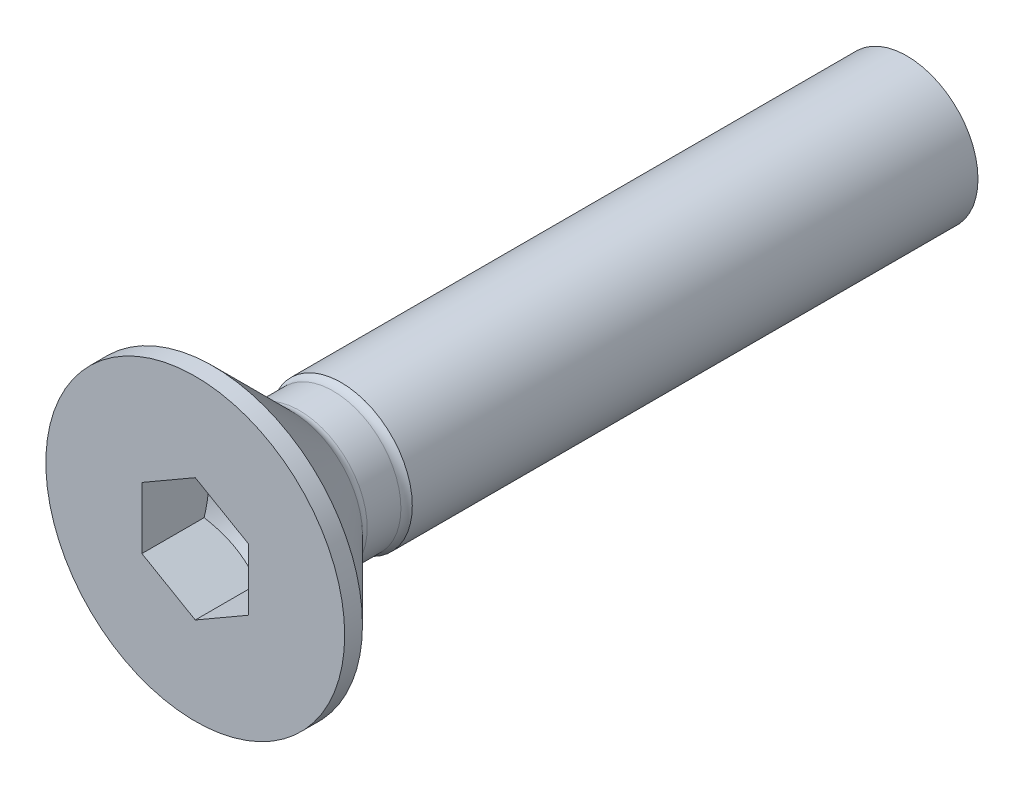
ISO-10303-21;
HEADER;
FILE_DESCRIPTION(('STEP AP214'),'2;1');
FILE_NAME('part.step','',(''),(''),'','','');
FILE_SCHEMA(('AUTOMOTIVE_DESIGN { 1 0 10303 214 1 1 1 1 }'));
ENDSEC;
DATA;
#1=APPLICATION_CONTEXT('core data for automotive mechanical design processes');
#2=APPLICATION_PROTOCOL_DEFINITION('international standard','automotive_design',2000,#1);
#3=PRODUCT_CONTEXT('',#1,'mechanical');
#4=PRODUCT('Part','Part','',(#3));
#5=PRODUCT_RELATED_PRODUCT_CATEGORY('part','',(#4));
#6=PRODUCT_DEFINITION_FORMATION('','',#4);
#7=PRODUCT_DEFINITION_CONTEXT('part definition',#1,'design');
#8=PRODUCT_DEFINITION('design','',#6,#7);
#9=PRODUCT_DEFINITION_SHAPE('','',#8);
#10=(LENGTH_UNIT() NAMED_UNIT(*) SI_UNIT(.MILLI.,.METRE.));
#11=(NAMED_UNIT(*) PLANE_ANGLE_UNIT() SI_UNIT($,.RADIAN.));
#12=(NAMED_UNIT(*) SI_UNIT($,.STERADIAN.) SOLID_ANGLE_UNIT());
#13=UNCERTAINTY_MEASURE_WITH_UNIT(LENGTH_MEASURE(1.E-05),#10,'distance_accuracy_value','');
#14=(GEOMETRIC_REPRESENTATION_CONTEXT(3) GLOBAL_UNCERTAINTY_ASSIGNED_CONTEXT((#13)) GLOBAL_UNIT_ASSIGNED_CONTEXT((#10,
#11,#12)) REPRESENTATION_CONTEXT('',''));
#15=CARTESIAN_POINT('',(0.,0.,0.));
#16=DIRECTION('',(0.,0.,1.));
#17=DIRECTION('',(1.,0.,0.));
#18=AXIS2_PLACEMENT_3D('',#15,#16,#17);
#19=CARTESIAN_POINT('',(0.,4.2,0.));
#20=DIRECTION('',(0.,0.,-1.));
#21=DIRECTION('',(-1.,0.,0.));
#22=AXIS2_PLACEMENT_3D('',#19,#20,#21);
#23=PLANE('',#22);
#24=CARTESIAN_POINT('',(0.,0.,0.));
#25=DIRECTION('',(0.,0.,1.));
#26=DIRECTION('',(1.,0.,0.));
#27=AXIS2_PLACEMENT_3D('',#24,#25,#26);
#28=CIRCLE('',#27,4.2);
#29=CARTESIAN_POINT('',(4.2,0.,0.));
#30=VERTEX_POINT('',#29);
#31=EDGE_CURVE('E107',#30,#30,#28,.T.);
#32=ORIENTED_EDGE('',*,*,#31,.T.);
#33=EDGE_LOOP('',(#32));
#34=FACE_BOUND('',#33,.T.);
#35=DIRECTION('',(-0.866025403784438,-0.5,0.));
#36=VECTOR('',#35,1.);
#37=CARTESIAN_POINT('',(1.49999930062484,-0.866025,0.));
#38=LINE('',#37,#36);
#39=CARTESIAN_POINT('',(1.49999930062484,-0.866025,0.));
#40=VERTEX_POINT('',#39);
#41=CARTESIAN_POINT('',(0.,-1.73205,0.));
#42=VERTEX_POINT('',#41);
#43=EDGE_CURVE('E30',#40,#42,#38,.T.);
#44=ORIENTED_EDGE('',*,*,#43,.T.);
#45=DIRECTION('',(-0.866025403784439,0.5,0.));
#46=VECTOR('',#45,1.);
#47=CARTESIAN_POINT('',(0.,-1.73205,0.));
#48=LINE('',#47,#46);
#49=CARTESIAN_POINT('',(-1.49999930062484,-0.866025,0.));
#50=VERTEX_POINT('',#49);
#51=EDGE_CURVE('E176',#42,#50,#48,.T.);
#52=ORIENTED_EDGE('',*,*,#51,.T.);
#53=DIRECTION('',(0.,1.,0.));
#54=VECTOR('',#53,1.);
#55=CARTESIAN_POINT('',(-1.49999930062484,-0.866025,0.));
#56=LINE('',#55,#54);
#57=CARTESIAN_POINT('',(-1.49999930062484,0.866025,0.));
#58=VERTEX_POINT('',#57);
#59=EDGE_CURVE('E231',#50,#58,#56,.T.);
#60=ORIENTED_EDGE('',*,*,#59,.T.);
#61=DIRECTION('',(0.866025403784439,0.5,0.));
#62=VECTOR('',#61,1.);
#63=CARTESIAN_POINT('',(-1.49999930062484,0.866025,0.));
#64=LINE('',#63,#62);
#65=CARTESIAN_POINT('',(0.,1.73205,0.));
#66=VERTEX_POINT('',#65);
#67=EDGE_CURVE('E229',#58,#66,#64,.T.);
#68=ORIENTED_EDGE('',*,*,#67,.T.);
#69=DIRECTION('',(0.866025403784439,-0.5,0.));
#70=VECTOR('',#69,1.);
#71=CARTESIAN_POINT('',(0.,1.73205,0.));
#72=LINE('',#71,#70);
#73=CARTESIAN_POINT('',(1.49999930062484,0.866025,0.));
#74=VERTEX_POINT('',#73);
#75=EDGE_CURVE('E96',#66,#74,#72,.T.);
#76=ORIENTED_EDGE('',*,*,#75,.T.);
#77=DIRECTION('',(0.,-1.,0.));
#78=VECTOR('',#77,1.);
#79=CARTESIAN_POINT('',(1.49999930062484,0.866025,0.));
#80=LINE('',#79,#78);
#81=EDGE_CURVE('E92',#74,#40,#80,.T.);
#82=ORIENTED_EDGE('',*,*,#81,.T.);
#83=EDGE_LOOP('',(#44,#52,#60,#68,#76,#82));
#84=FACE_BOUND('',#83,.T.);
#85=ADVANCED_FACE('F16',(#34,#84),#23,.F.);
#86=CARTESIAN_POINT('',(0.,0.,-20.));
#87=DIRECTION('',(0.,0.,1.));
#88=DIRECTION('',(1.,0.,0.));
#89=AXIS2_PLACEMENT_3D('',#86,#87,#88);
#90=PLANE('',#89);
#91=CARTESIAN_POINT('',(0.,0.,-20.));
#92=DIRECTION('',(0.,0.,1.));
#93=DIRECTION('',(1.,0.,0.));
#94=AXIS2_PLACEMENT_3D('',#91,#92,#93);
#95=CIRCLE('',#94,2.);
#96=CARTESIAN_POINT('',(2.,0.,-20.));
#97=VERTEX_POINT('',#96);
#98=EDGE_CURVE('E11',#97,#97,#95,.T.);
#99=ORIENTED_EDGE('',*,*,#98,.F.);
#100=EDGE_LOOP('',(#99));
#101=FACE_BOUND('',#100,.T.);
#102=ADVANCED_FACE('F130',(#101),#90,.F.);
#103=CARTESIAN_POINT('',(0.,0.,0.));
#104=DIRECTION('',(0.,0.,1.));
#105=DIRECTION('',(1.,0.,0.));
#106=AXIS2_PLACEMENT_3D('',#103,#104,#105);
#107=CYLINDRICAL_SURFACE('',#106,2.);
#108=CARTESIAN_POINT('',(0.,0.,-4.1));
#109=DIRECTION('',(0.,0.,1.));
#110=DIRECTION('',(1.,0.,0.));
#111=AXIS2_PLACEMENT_3D('',#108,#109,#110);
#112=CIRCLE('',#111,2.);
#113=CARTESIAN_POINT('',(2.,0.,-4.1));
#114=VERTEX_POINT('',#113);
#115=EDGE_CURVE('E23',#114,#114,#112,.T.);
#116=ORIENTED_EDGE('',*,*,#115,.F.);
#117=EDGE_LOOP('',(#116));
#118=FACE_BOUND('',#117,.T.);
#119=ORIENTED_EDGE('',*,*,#98,.T.);
#120=EDGE_LOOP('',(#119));
#121=FACE_BOUND('',#120,.T.);
#122=ADVANCED_FACE('F127',(#118,#121),#107,.T.);
#123=CARTESIAN_POINT('',(0.,0.,-3.8737258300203));
#124=DIRECTION('',(0.,0.,1.));
#125=DIRECTION('',(1.,0.,0.));
#126=AXIS2_PLACEMENT_3D('',#123,#124,#125);
#127=TOROIDAL_SURFACE('',#126,2.2262741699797,0.32);
#128=ORIENTED_EDGE('',*,*,#115,.T.);
#129=EDGE_LOOP('',(#128));
#130=FACE_BOUND('',#129,.T.);
#131=CARTESIAN_POINT('',(0.,0.,-3.8737258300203));
#132=DIRECTION('',(0.,0.,1.));
#133=DIRECTION('',(1.,0.,0.));
#134=AXIS2_PLACEMENT_3D('',#131,#132,#133);
#135=CIRCLE('',#134,1.9062741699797);
#136=CARTESIAN_POINT('',(1.9062741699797,0.,-3.8737258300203));
#137=VERTEX_POINT('',#136);
#138=EDGE_CURVE('E119',#137,#137,#135,.T.);
#139=ORIENTED_EDGE('',*,*,#138,.F.);
#140=EDGE_LOOP('',(#139));
#141=FACE_BOUND('',#140,.T.);
#142=ADVANCED_FACE('F124',(#130,#141),#127,.F.);
#143=CARTESIAN_POINT('',(0.,0.,0.));
#144=DIRECTION('',(0.,0.,1.));
#145=DIRECTION('',(1.,0.,0.));
#146=AXIS2_PLACEMENT_3D('',#143,#144,#145);
#147=CYLINDRICAL_SURFACE('',#146,1.9062741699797);
#148=CARTESIAN_POINT('',(0.,0.,-2.9262741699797));
#149=DIRECTION('',(0.,0.,1.));
#150=DIRECTION('',(1.,0.,0.));
#151=AXIS2_PLACEMENT_3D('',#148,#149,#150);
#152=CIRCLE('',#151,1.9062741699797);
#153=CARTESIAN_POINT('',(1.9062741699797,0.,-2.9262741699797));
#154=VERTEX_POINT('',#153);
#155=EDGE_CURVE('E116',#154,#154,#152,.T.);
#156=ORIENTED_EDGE('',*,*,#155,.F.);
#157=EDGE_LOOP('',(#156));
#158=FACE_BOUND('',#157,.T.);
#159=ORIENTED_EDGE('',*,*,#138,.T.);
#160=EDGE_LOOP('',(#159));
#161=FACE_BOUND('',#160,.T.);
#162=ADVANCED_FACE('F143',(#158,#161),#147,.T.);
#163=CARTESIAN_POINT('',(0.,0.,-2.9262741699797));
#164=DIRECTION('',(0.,0.,1.));
#165=DIRECTION('',(1.,0.,0.));
#166=AXIS2_PLACEMENT_3D('',#163,#164,#165);
#167=TOROIDAL_SURFACE('',#166,2.2262741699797,0.32);
#168=ORIENTED_EDGE('',*,*,#155,.T.);
#169=EDGE_LOOP('',(#168));
#170=FACE_BOUND('',#169,.T.);
#171=CARTESIAN_POINT('',(0.,0.,-2.7));
#172=DIRECTION('',(0.,0.,1.));
#173=DIRECTION('',(1.,0.,0.));
#174=AXIS2_PLACEMENT_3D('',#171,#172,#173);
#175=CIRCLE('',#174,2.);
#176=CARTESIAN_POINT('',(2.,0.,-2.7));
#177=VERTEX_POINT('',#176);
#178=EDGE_CURVE('E113',#177,#177,#175,.T.);
#179=ORIENTED_EDGE('',*,*,#178,.F.);
#180=EDGE_LOOP('',(#179));
#181=FACE_BOUND('',#180,.T.);
#182=ADVANCED_FACE('F146',(#170,#181),#167,.F.);
#183=CARTESIAN_POINT('',(0.,0.,-2.7));
#184=DIRECTION('',(0.,0.,1.));
#185=DIRECTION('',(1.,0.,0.));
#186=AXIS2_PLACEMENT_3D('',#183,#184,#185);
#187=CONICAL_SURFACE('',#186,2.,0.785398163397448);
#188=CARTESIAN_POINT('',(0.,0.,-0.5));
#189=DIRECTION('',(0.,0.,1.));
#190=DIRECTION('',(1.,0.,0.));
#191=AXIS2_PLACEMENT_3D('',#188,#189,#190);
#192=CIRCLE('',#191,4.2);
#193=CARTESIAN_POINT('',(4.2,0.,-0.5));
#194=VERTEX_POINT('',#193);
#195=EDGE_CURVE('E110',#194,#194,#192,.T.);
#196=ORIENTED_EDGE('',*,*,#195,.F.);
#197=EDGE_LOOP('',(#196));
#198=FACE_BOUND('',#197,.T.);
#199=ORIENTED_EDGE('',*,*,#178,.T.);
#200=EDGE_LOOP('',(#199));
#201=FACE_BOUND('',#200,.T.);
#202=ADVANCED_FACE('F150',(#198,#201),#187,.T.);
#203=CARTESIAN_POINT('',(0.,0.,0.));
#204=DIRECTION('',(0.,0.,1.));
#205=DIRECTION('',(1.,0.,0.));
#206=AXIS2_PLACEMENT_3D('',#203,#204,#205);
#207=CYLINDRICAL_SURFACE('',#206,4.2);
#208=ORIENTED_EDGE('',*,*,#31,.F.);
#209=EDGE_LOOP('',(#208));
#210=FACE_BOUND('',#209,.T.);
#211=ORIENTED_EDGE('',*,*,#195,.T.);
#212=EDGE_LOOP('',(#211));
#213=FACE_BOUND('',#212,.T.);
#214=ADVANCED_FACE('F154',(#210,#213),#207,.T.);
#215=CARTESIAN_POINT('',(1.49999930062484,-0.866025,-2.74999953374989));
#216=DIRECTION('',(-0.5,0.866025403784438,0.));
#217=DIRECTION('',(0.866025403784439,0.5,0.));
#218=AXIS2_PLACEMENT_3D('',#215,#216,#217);
#219=PLANE('',#218);
#220=DIRECTION('',(0.,0.,1.));
#221=VECTOR('',#220,1.);
#222=CARTESIAN_POINT('',(0.,-1.73205,-2.74999953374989));
#223=LINE('',#222,#221);
#224=CARTESIAN_POINT('',(0.,-1.73205,-1.75));
#225=VERTEX_POINT('',#224);
#226=EDGE_CURVE('E105',#225,#42,#223,.T.);
#227=ORIENTED_EDGE('',*,*,#226,.T.);
#228=ORIENTED_EDGE('',*,*,#43,.F.);
#229=DIRECTION('',(0.,0.,1.));
#230=VECTOR('',#229,1.);
#231=CARTESIAN_POINT('',(1.49999930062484,-0.866025,-2.74999953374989));
#232=LINE('',#231,#230);
#233=CARTESIAN_POINT('',(1.49999930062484,-0.866025,-1.75));
#234=VERTEX_POINT('',#233);
#235=EDGE_CURVE('E86',#234,#40,#232,.T.);
#236=ORIENTED_EDGE('',*,*,#235,.F.);
#237=CARTESIAN_POINT('',(-1.99999999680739E-07,-1.73205011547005,-1.74999993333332));
#238=CARTESIAN_POINT('',(0.0659156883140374,-1.69399355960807,-1.77197826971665));
#239=CARTESIAN_POINT('',(0.132400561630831,-1.65560850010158,-1.79196641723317));
#240=CARTESIAN_POINT('',(0.266521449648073,-1.57817376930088,-1.82685513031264));
#241=CARTESIAN_POINT('',(0.334159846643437,-1.53912272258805,-1.84174335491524));
#242=CARTESIAN_POINT('',(0.468598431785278,-1.46150456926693,-1.86491795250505));
#243=CARTESIAN_POINT('',(0.535377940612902,-1.42294940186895,-1.87335858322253));
#244=CARTESIAN_POINT('',(0.669251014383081,-1.3456577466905,-1.88343305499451));
#245=CARTESIAN_POINT('',(0.736344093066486,-1.30692153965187,-1.88507524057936));
#246=CARTESIAN_POINT('',(0.861700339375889,-1.23454707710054,-1.88165022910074));
#247=CARTESIAN_POINT('',(0.919982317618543,-1.20089796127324,-1.87742398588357));
#248=CARTESIAN_POINT('',(1.03616658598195,-1.13381894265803,-1.86403197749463));
#249=CARTESIAN_POINT('',(1.09406847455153,-1.10038927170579,-1.8548616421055));
#250=CARTESIAN_POINT('',(1.21049209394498,-1.03317206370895,-1.83193757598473));
#251=CARTESIAN_POINT('',(1.26899909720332,-0.99939302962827,-1.81808671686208));
#252=CARTESIAN_POINT('',(1.38514072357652,-0.932338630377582,-1.78665112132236));
#253=CARTESIAN_POINT('',(1.44277683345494,-0.899062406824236,-1.76907376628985));
#254=CARTESIAN_POINT('',(1.49999950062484,-0.866024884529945,-1.74999993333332));
#255=B_SPLINE_CURVE_WITH_KNOTS('',3,(#237,#238,#239,#240,#241,#242,#243,#244,#245,#246,#247,
#248,#249,#250,#251,#252,#253,#254),.UNSPECIFIED.,.F.,.F.,(4,2,2,2,2,2,2,2,4),(0.,
0.237761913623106,0.476095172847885,0.708530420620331,0.940680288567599,1.14278046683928,
1.34506778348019,1.5518408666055,1.75820814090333),.UNSPECIFIED.);
#256=EDGE_CURVE('E79',#225,#234,#255,.T.);
#257=ORIENTED_EDGE('',*,*,#256,.F.);
#258=EDGE_LOOP('',(#227,#228,#236,#257));
#259=FACE_BOUND('',#258,.T.);
#260=ADVANCED_FACE('F87',(#259),#219,.T.);
#261=CARTESIAN_POINT('',(0.,-1.73205,-2.74999953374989));
#262=DIRECTION('',(0.5,0.866025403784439,0.));
#263=DIRECTION('',(0.866025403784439,-0.5,0.));
#264=AXIS2_PLACEMENT_3D('',#261,#262,#263);
#265=PLANE('',#264);
#266=DIRECTION('',(0.,0.,1.));
#267=VECTOR('',#266,1.);
#268=CARTESIAN_POINT('',(-1.49999930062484,-0.866025,-2.74999953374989));
#269=LINE('',#268,#267);
#270=CARTESIAN_POINT('',(-1.49999930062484,-0.866025,-1.75));
#271=VERTEX_POINT('',#270);
#272=EDGE_CURVE('E103',#271,#50,#269,.T.);
#273=ORIENTED_EDGE('',*,*,#272,.T.);
#274=ORIENTED_EDGE('',*,*,#51,.F.);
#275=ORIENTED_EDGE('',*,*,#226,.F.);
#276=CARTESIAN_POINT('',(-1.49999950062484,-0.866024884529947,-1.74999993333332));
#277=CARTESIAN_POINT('',(-1.4340836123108,-0.904081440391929,-1.77197826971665));
#278=CARTESIAN_POINT('',(-1.36759873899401,-0.942466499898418,-1.79196641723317));
#279=CARTESIAN_POINT('',(-1.23347785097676,-1.01990123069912,-1.82685513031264));
#280=CARTESIAN_POINT('',(-1.1658394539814,-1.05895227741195,-1.84174335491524));
#281=CARTESIAN_POINT('',(-1.03140086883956,-1.13657043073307,-1.86491795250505));
#282=CARTESIAN_POINT('',(-0.964621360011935,-1.17512559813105,-1.87335858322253));
#283=CARTESIAN_POINT('',(-0.830748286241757,-1.2524172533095,-1.88343305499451));
#284=CARTESIAN_POINT('',(-0.763655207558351,-1.29115346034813,-1.88507524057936));
#285=CARTESIAN_POINT('',(-0.638298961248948,-1.36352792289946,-1.88165022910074));
#286=CARTESIAN_POINT('',(-0.580016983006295,-1.39717703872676,-1.87742398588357));
#287=CARTESIAN_POINT('',(-0.46383271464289,-1.46425605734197,-1.86403197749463));
#288=CARTESIAN_POINT('',(-0.405930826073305,-1.49768572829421,-1.8548616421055));
#289=CARTESIAN_POINT('',(-0.289507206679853,-1.56490293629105,-1.83193757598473));
#290=CARTESIAN_POINT('',(-0.231000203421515,-1.59868197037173,-1.81808671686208));
#291=CARTESIAN_POINT('',(-0.114858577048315,-1.66573636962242,-1.78665112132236));
#292=CARTESIAN_POINT('',(-0.0572224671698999,-1.69901259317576,-1.76907376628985));
#293=CARTESIAN_POINT('',(2.00000000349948E-07,-1.73205011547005,-1.74999993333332));
#294=B_SPLINE_CURVE_WITH_KNOTS('',3,(#276,#277,#278,#279,#280,#281,#282,#283,#284,#285,#286,
#287,#288,#289,#290,#291,#292,#293),.UNSPECIFIED.,.F.,.F.,(4,2,2,2,2,2,2,2,4),(0.,
0.237761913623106,0.476095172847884,0.70853042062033,0.940680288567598,1.14278046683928,
1.34506778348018,1.5518408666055,1.75820814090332),.UNSPECIFIED.);
#295=EDGE_CURVE('E83',#271,#225,#294,.T.);
#296=ORIENTED_EDGE('',*,*,#295,.F.);
#297=EDGE_LOOP('',(#273,#274,#275,#296));
#298=FACE_BOUND('',#297,.T.);
#299=ADVANCED_FACE('F162',(#298),#265,.T.);
#300=CARTESIAN_POINT('',(-1.49999930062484,-0.866025,-2.74999953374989));
#301=DIRECTION('',(1.,0.,0.));
#302=DIRECTION('',(0.,-1.,0.));
#303=AXIS2_PLACEMENT_3D('',#300,#301,#302);
#304=PLANE('',#303);
#305=DIRECTION('',(0.,0.,1.));
#306=VECTOR('',#305,1.);
#307=CARTESIAN_POINT('',(-1.49999930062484,0.866025,-2.74999953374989));
#308=LINE('',#307,#306);
#309=CARTESIAN_POINT('',(-1.49999930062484,0.866025,-1.75));
#310=VERTEX_POINT('',#309);
#311=EDGE_CURVE('E101',#310,#58,#308,.T.);
#312=ORIENTED_EDGE('',*,*,#311,.T.);
#313=ORIENTED_EDGE('',*,*,#59,.F.);
#314=ORIENTED_EDGE('',*,*,#272,.F.);
#315=CARTESIAN_POINT('',(-1.49999930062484,-2.24271663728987,-1.19224732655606));
#316=CARTESIAN_POINT('',(-1.49999930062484,-2.17794141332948,-1.2233240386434));
#317=CARTESIAN_POINT('',(-1.49999930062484,-2.11300852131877,-1.25407788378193));
#318=CARTESIAN_POINT('',(-1.49999930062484,-1.98274303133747,-1.31475688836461));
#319=CARTESIAN_POINT('',(-1.49999930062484,-1.91741036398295,-1.34468189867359));
#320=CARTESIAN_POINT('',(-1.49999930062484,-1.78588635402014,-1.40368745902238));
#321=CARTESIAN_POINT('',(-1.49999930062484,-1.71969220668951,-1.43276178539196));
#322=CARTESIAN_POINT('',(-1.49999930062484,-1.58674953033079,-1.48960603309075));
#323=CARTESIAN_POINT('',(-1.49999930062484,-1.52000103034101,-1.51737602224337));
#324=CARTESIAN_POINT('',(-1.49999930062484,-1.3840803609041,-1.57197454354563));
#325=CARTESIAN_POINT('',(-1.49999930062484,-1.31489044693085,-1.59875948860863));
#326=CARTESIAN_POINT('',(-1.49999930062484,-1.17568875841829,-1.65009347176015));
#327=CARTESIAN_POINT('',(-1.49999930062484,-1.10567688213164,-1.67464222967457));
#328=CARTESIAN_POINT('',(-1.49999930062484,-0.894522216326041,-1.74389891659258));
#329=CARTESIAN_POINT('',(-1.49999930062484,-0.751873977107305,-1.78437972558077));
#330=CARTESIAN_POINT('',(-1.49999930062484,-0.535047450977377,-1.83133547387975));
#331=CARTESIAN_POINT('',(-1.49999930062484,-0.462365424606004,-1.8446870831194));
#332=CARTESIAN_POINT('',(-1.49999930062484,-0.316183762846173,-1.86588652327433));
#333=CARTESIAN_POINT('',(-1.49999930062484,-0.242684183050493,-1.8737347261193));
#334=CARTESIAN_POINT('',(-1.49999930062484,-0.0961588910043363,-1.88320140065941));
#335=CARTESIAN_POINT('',(-1.49999930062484,-0.0231380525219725,-1.88489338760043));
#336=CARTESIAN_POINT('',(-1.49999930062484,0.122783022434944,-1.8821005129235));
#337=CARTESIAN_POINT('',(-1.49999930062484,0.195683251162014,-1.87761526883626));
#338=CARTESIAN_POINT('',(-1.49999930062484,0.375553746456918,-1.85932231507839));
#339=CARTESIAN_POINT('',(-1.49999930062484,0.482175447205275,-1.84208645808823));
#340=CARTESIAN_POINT('',(-1.49999930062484,0.693345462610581,-1.79764015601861));
#341=CARTESIAN_POINT('',(-1.49999930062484,0.797891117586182,-1.77041768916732));
#342=CARTESIAN_POINT('',(-1.49999930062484,0.954250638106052,-1.72391506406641));
#343=CARTESIAN_POINT('',(-1.49999930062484,1.00687274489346,-1.70725248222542));
#344=CARTESIAN_POINT('',(-1.49999930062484,1.11156919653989,-1.67238593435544));
#345=CARTESIAN_POINT('',(-1.49999930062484,1.16364386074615,-1.65418293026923));
#346=CARTESIAN_POINT('',(-1.49999930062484,1.26731501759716,-1.61649989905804));
#347=CARTESIAN_POINT('',(-1.49999930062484,1.31891159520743,-1.59702010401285));
#348=CARTESIAN_POINT('',(-1.49999930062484,1.4216981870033,-1.55699419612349));
#349=CARTESIAN_POINT('',(-1.49999930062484,1.472888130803,-1.53644790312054));
#350=CARTESIAN_POINT('',(-1.49999930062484,1.60355204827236,-1.48268670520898));
#351=CARTESIAN_POINT('',(-1.49999930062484,1.68276475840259,-1.44883749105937));
#352=CARTESIAN_POINT('',(-1.49999930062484,1.84047486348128,-1.37950734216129));
#353=CARTESIAN_POINT('',(-1.49999930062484,1.91897220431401,-1.34402628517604));
#354=CARTESIAN_POINT('',(-1.49999930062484,2.15362953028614,-1.23571059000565));
#355=CARTESIAN_POINT('',(-1.49999930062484,2.30892860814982,-1.16101453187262));
#356=CARTESIAN_POINT('',(-1.49999930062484,2.61819999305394,-1.00848967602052));
#357=CARTESIAN_POINT('',(-1.49999930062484,2.77217043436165,-0.930657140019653));
#358=CARTESIAN_POINT('',(-1.49999930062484,3.07905639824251,-0.772990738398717));
#359=CARTESIAN_POINT('',(-1.49999930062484,3.23197205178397,-0.693157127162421));
#360=CARTESIAN_POINT('',(-1.49999930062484,3.52267463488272,-0.539711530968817));
#361=CARTESIAN_POINT('',(-1.49999930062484,3.66052723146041,-0.466223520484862));
#362=CARTESIAN_POINT('',(-1.49999930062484,3.93578899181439,-0.318410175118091));
#363=CARTESIAN_POINT('',(-1.49999930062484,4.07319813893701,-0.244084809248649));
#364=CARTESIAN_POINT('',(-1.49999930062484,4.34732572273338,-0.0949965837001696));
#365=CARTESIAN_POINT('',(-1.49999930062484,4.48404502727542,-0.0202353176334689));
#366=CARTESIAN_POINT('',(-1.49999930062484,4.75720722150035,0.129773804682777));
#367=CARTESIAN_POINT('',(-1.49999930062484,4.89365012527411,0.205021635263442));
#368=CARTESIAN_POINT('',(-1.49999930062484,5.02999372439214,0.280447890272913));
#369=B_SPLINE_CURVE_WITH_KNOTS('',3,(#315,#316,#317,#318,#319,#320,#321,#322,#323,#324,#325,
#326,#327,#328,#329,#330,#331,#332,#333,#334,#335,#336,#337,#338,#339,#340,#341,#342,#343,#344,
#345,#346,#347,#348,#349,#350,#351,#352,#353,#354,#355,#356,#357,#358,#359,#360,#361,#362,#363,
#364,#365,#366,#367,#368),.UNSPECIFIED.,.F.,.F.,(4,2,2,2,2,2,2,2,2,2,2,2,2,2,2,2,2,2,2,2,2,2,2,
2,2,2,4),(0.,0.215535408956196,0.431109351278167,0.647990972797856,0.864861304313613,
1.08740082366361,1.30996818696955,1.75384735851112,1.97537373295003,2.19688513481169,
2.41574248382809,2.63461338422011,2.95796620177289,3.28170955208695,3.4472828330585,
3.61275347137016,3.77819411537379,3.94366279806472,4.20206177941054,4.46048014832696,
4.97740223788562,5.49495979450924,6.012451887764,6.48110033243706,6.94976617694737,
7.41723996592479,7.88468929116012),.UNSPECIFIED.);
#370=EDGE_CURVE('E204',#310,#271,#369,.F.);
#371=ORIENTED_EDGE('',*,*,#370,.F.);
#372=EDGE_LOOP('',(#312,#313,#314,#371));
#373=FACE_BOUND('',#372,.T.);
#374=ADVANCED_FACE('F209',(#373),#304,.T.);
#375=CARTESIAN_POINT('',(-1.49999930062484,0.866025,-2.74999953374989));
#376=DIRECTION('',(0.5,-0.866025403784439,0.));
#377=DIRECTION('',(-0.866025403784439,-0.5,0.));
#378=AXIS2_PLACEMENT_3D('',#375,#376,#377);
#379=PLANE('',#378);
#380=DIRECTION('',(0.,0.,1.));
#381=VECTOR('',#380,1.);
#382=CARTESIAN_POINT('',(0.,1.73205,-2.74999953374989));
#383=LINE('',#382,#381);
#384=CARTESIAN_POINT('',(0.,1.73205,-1.75));
#385=VERTEX_POINT('',#384);
#386=EDGE_CURVE('E94',#385,#66,#383,.T.);
#387=ORIENTED_EDGE('',*,*,#386,.T.);
#388=ORIENTED_EDGE('',*,*,#67,.F.);
#389=ORIENTED_EDGE('',*,*,#311,.F.);
#390=CARTESIAN_POINT('',(1.99999999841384E-07,1.73205011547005,-1.74999993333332));
#391=CARTESIAN_POINT('',(-0.0659156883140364,1.69399355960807,-1.77197826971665));
#392=CARTESIAN_POINT('',(-0.13240056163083,1.65560850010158,-1.79196641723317));
#393=CARTESIAN_POINT('',(-0.266521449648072,1.57817376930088,-1.82685513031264));
#394=CARTESIAN_POINT('',(-0.334159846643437,1.53912272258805,-1.84174335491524));
#395=CARTESIAN_POINT('',(-0.468598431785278,1.46150456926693,-1.86491795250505));
#396=CARTESIAN_POINT('',(-0.535377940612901,1.42294940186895,-1.87335858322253));
#397=CARTESIAN_POINT('',(-0.66925101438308,1.3456577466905,-1.88343305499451));
#398=CARTESIAN_POINT('',(-0.736344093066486,1.30692153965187,-1.88507524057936));
#399=CARTESIAN_POINT('',(-0.861700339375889,1.23454707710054,-1.88165022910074));
#400=CARTESIAN_POINT('',(-0.919982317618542,1.20089796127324,-1.87742398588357));
#401=CARTESIAN_POINT('',(-1.03616658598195,1.13381894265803,-1.86403197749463));
#402=CARTESIAN_POINT('',(-1.09406847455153,1.10038927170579,-1.8548616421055));
#403=CARTESIAN_POINT('',(-1.21049209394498,1.03317206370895,-1.83193757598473));
#404=CARTESIAN_POINT('',(-1.26899909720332,0.99939302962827,-1.81808671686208));
#405=CARTESIAN_POINT('',(-1.38514072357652,0.932338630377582,-1.78665112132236));
#406=CARTESIAN_POINT('',(-1.44277683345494,0.899062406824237,-1.76907376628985));
#407=CARTESIAN_POINT('',(-1.49999950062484,0.866024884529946,-1.74999993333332));
#408=B_SPLINE_CURVE_WITH_KNOTS('',3,(#390,#391,#392,#393,#394,#395,#396,#397,#398,#399,#400,
#401,#402,#403,#404,#405,#406,#407),.UNSPECIFIED.,.F.,.F.,(4,2,2,2,2,2,2,2,4),(0.,
0.237761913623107,0.476095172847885,0.708530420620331,0.940680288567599,1.14278046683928,
1.34506778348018,1.5518408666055,1.75820814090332),.UNSPECIFIED.);
#409=EDGE_CURVE('E198',#385,#310,#408,.T.);
#410=ORIENTED_EDGE('',*,*,#409,.F.);
#411=EDGE_LOOP('',(#387,#388,#389,#410));
#412=FACE_BOUND('',#411,.T.);
#413=ADVANCED_FACE('F212',(#412),#379,.T.);
#414=CARTESIAN_POINT('',(0.,1.73205,-2.74999953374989));
#415=DIRECTION('',(-0.5,-0.866025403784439,0.));
#416=DIRECTION('',(-0.866025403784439,0.5,0.));
#417=AXIS2_PLACEMENT_3D('',#414,#415,#416);
#418=PLANE('',#417);
#419=DIRECTION('',(0.,0.,1.));
#420=VECTOR('',#419,1.);
#421=CARTESIAN_POINT('',(1.49999930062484,0.866025,-2.74999953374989));
#422=LINE('',#421,#420);
#423=CARTESIAN_POINT('',(1.49999930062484,0.866025,-1.75));
#424=VERTEX_POINT('',#423);
#425=EDGE_CURVE('E91',#424,#74,#422,.T.);
#426=ORIENTED_EDGE('',*,*,#425,.T.);
#427=ORIENTED_EDGE('',*,*,#75,.F.);
#428=ORIENTED_EDGE('',*,*,#386,.F.);
#429=CARTESIAN_POINT('',(1.49999950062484,0.866024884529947,-1.74999993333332));
#430=CARTESIAN_POINT('',(1.4340836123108,0.90408144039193,-1.77197826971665));
#431=CARTESIAN_POINT('',(1.36759873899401,0.942466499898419,-1.79196641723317));
#432=CARTESIAN_POINT('',(1.23347785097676,1.01990123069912,-1.82685513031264));
#433=CARTESIAN_POINT('',(1.1658394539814,1.05895227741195,-1.84174335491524));
#434=CARTESIAN_POINT('',(1.03140086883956,1.13657043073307,-1.86491795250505));
#435=CARTESIAN_POINT('',(0.964621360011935,1.17512559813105,-1.87335858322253));
#436=CARTESIAN_POINT('',(0.830748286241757,1.2524172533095,-1.88343305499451));
#437=CARTESIAN_POINT('',(0.763655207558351,1.29115346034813,-1.88507524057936));
#438=CARTESIAN_POINT('',(0.638298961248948,1.36352792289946,-1.88165022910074));
#439=CARTESIAN_POINT('',(0.580016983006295,1.39717703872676,-1.87742398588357));
#440=CARTESIAN_POINT('',(0.46383271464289,1.46425605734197,-1.86403197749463));
#441=CARTESIAN_POINT('',(0.405930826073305,1.49768572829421,-1.8548616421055));
#442=CARTESIAN_POINT('',(0.289507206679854,1.56490293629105,-1.83193757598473));
#443=CARTESIAN_POINT('',(0.231000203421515,1.59868197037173,-1.81808671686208));
#444=CARTESIAN_POINT('',(0.114858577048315,1.66573636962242,-1.78665112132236));
#445=CARTESIAN_POINT('',(0.0572224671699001,1.69901259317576,-1.76907376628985));
#446=CARTESIAN_POINT('',(-2.00000000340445E-07,1.73205011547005,-1.74999993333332));
#447=B_SPLINE_CURVE_WITH_KNOTS('',3,(#429,#430,#431,#432,#433,#434,#435,#436,#437,#438,#439,
#440,#441,#442,#443,#444,#445,#446),.UNSPECIFIED.,.F.,.F.,(4,2,2,2,2,2,2,2,4),(0.,
0.237761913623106,0.476095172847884,0.70853042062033,0.940680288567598,1.14278046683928,
1.34506778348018,1.5518408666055,1.75820814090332),.UNSPECIFIED.);
#448=EDGE_CURVE('E38',#424,#385,#447,.T.);
#449=ORIENTED_EDGE('',*,*,#448,.F.);
#450=EDGE_LOOP('',(#426,#427,#428,#449));
#451=FACE_BOUND('',#450,.T.);
#452=ADVANCED_FACE('F216',(#451),#418,.T.);
#453=CARTESIAN_POINT('',(1.49999930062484,0.866025,-2.74999953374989));
#454=DIRECTION('',(-1.,0.,0.));
#455=DIRECTION('',(0.,1.,0.));
#456=AXIS2_PLACEMENT_3D('',#453,#454,#455);
#457=PLANE('',#456);
#458=ORIENTED_EDGE('',*,*,#235,.T.);
#459=ORIENTED_EDGE('',*,*,#81,.F.);
#460=ORIENTED_EDGE('',*,*,#425,.F.);
#461=CARTESIAN_POINT('',(1.49999930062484,-2.24271663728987,-1.19224732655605));
#462=CARTESIAN_POINT('',(1.49999930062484,-2.17794141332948,-1.2233240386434));
#463=CARTESIAN_POINT('',(1.49999930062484,-2.11300852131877,-1.25407788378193));
#464=CARTESIAN_POINT('',(1.49999930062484,-1.98274303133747,-1.31475688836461));
#465=CARTESIAN_POINT('',(1.49999930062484,-1.91741036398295,-1.34468189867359));
#466=CARTESIAN_POINT('',(1.49999930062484,-1.78588635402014,-1.40368745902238));
#467=CARTESIAN_POINT('',(1.49999930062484,-1.71969220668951,-1.43276178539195));
#468=CARTESIAN_POINT('',(1.49999930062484,-1.58674953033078,-1.48960603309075));
#469=CARTESIAN_POINT('',(1.49999930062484,-1.520001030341,-1.51737602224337));
#470=CARTESIAN_POINT('',(1.49999930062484,-1.3840803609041,-1.57197454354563));
#471=CARTESIAN_POINT('',(1.49999930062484,-1.31489044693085,-1.59875948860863));
#472=CARTESIAN_POINT('',(1.49999930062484,-1.17568875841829,-1.65009347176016));
#473=CARTESIAN_POINT('',(1.49999930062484,-1.10567688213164,-1.67464222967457));
#474=CARTESIAN_POINT('',(1.49999930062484,-0.894522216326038,-1.74389891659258));
#475=CARTESIAN_POINT('',(1.49999930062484,-0.751873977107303,-1.78437972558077));
#476=CARTESIAN_POINT('',(1.49999930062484,-0.535047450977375,-1.83133547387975));
#477=CARTESIAN_POINT('',(1.49999930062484,-0.462365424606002,-1.8446870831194));
#478=CARTESIAN_POINT('',(1.49999930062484,-0.316183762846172,-1.86588652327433));
#479=CARTESIAN_POINT('',(1.49999930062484,-0.242684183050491,-1.8737347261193));
#480=CARTESIAN_POINT('',(1.49999930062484,-0.0961588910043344,-1.88320140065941));
#481=CARTESIAN_POINT('',(1.49999930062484,-0.0231380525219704,-1.88489338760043));
#482=CARTESIAN_POINT('',(1.49999930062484,0.122783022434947,-1.8821005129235));
#483=CARTESIAN_POINT('',(1.49999930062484,0.195683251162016,-1.87761526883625));
#484=CARTESIAN_POINT('',(1.49999930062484,0.375553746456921,-1.85932231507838));
#485=CARTESIAN_POINT('',(1.49999930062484,0.482175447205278,-1.84208645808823));
#486=CARTESIAN_POINT('',(1.49999930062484,0.693345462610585,-1.79764015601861));
#487=CARTESIAN_POINT('',(1.49999930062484,0.797891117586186,-1.77041768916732));
#488=CARTESIAN_POINT('',(1.49999930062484,0.954250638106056,-1.72391506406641));
#489=CARTESIAN_POINT('',(1.49999930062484,1.00687274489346,-1.70725248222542));
#490=CARTESIAN_POINT('',(1.49999930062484,1.1115691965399,-1.67238593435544));
#491=CARTESIAN_POINT('',(1.49999930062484,1.16364386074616,-1.65418293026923));
#492=CARTESIAN_POINT('',(1.49999930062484,1.26731501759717,-1.61649989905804));
#493=CARTESIAN_POINT('',(1.49999930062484,1.31891159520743,-1.59702010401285));
#494=CARTESIAN_POINT('',(1.49999930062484,1.4216981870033,-1.55699419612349));
#495=CARTESIAN_POINT('',(1.49999930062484,1.47288813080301,-1.53644790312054));
#496=CARTESIAN_POINT('',(1.49999930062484,1.60355204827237,-1.48268670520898));
#497=CARTESIAN_POINT('',(1.49999930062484,1.68276475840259,-1.44883749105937));
#498=CARTESIAN_POINT('',(1.49999930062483,1.84047486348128,-1.37950734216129));
#499=CARTESIAN_POINT('',(1.49999930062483,1.91897220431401,-1.34402628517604));
#500=CARTESIAN_POINT('',(1.49999930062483,2.15362953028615,-1.23571059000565));
#501=CARTESIAN_POINT('',(1.49999930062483,2.30892860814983,-1.16101453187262));
#502=CARTESIAN_POINT('',(1.49999930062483,2.61819999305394,-1.00848967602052));
#503=CARTESIAN_POINT('',(1.49999930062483,2.77217043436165,-0.930657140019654));
#504=CARTESIAN_POINT('',(1.49999930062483,3.07905639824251,-0.772990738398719));
#505=CARTESIAN_POINT('',(1.49999930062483,3.23197205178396,-0.693157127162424));
#506=CARTESIAN_POINT('',(1.49999930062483,3.52267463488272,-0.53971153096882));
#507=CARTESIAN_POINT('',(1.49999930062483,3.66052723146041,-0.466223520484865));
#508=CARTESIAN_POINT('',(1.49999930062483,3.93578899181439,-0.318410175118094));
#509=CARTESIAN_POINT('',(1.49999930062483,4.07319813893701,-0.244084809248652));
#510=CARTESIAN_POINT('',(1.49999930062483,4.34732572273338,-0.0949965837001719));
#511=CARTESIAN_POINT('',(1.49999930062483,4.48404502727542,-0.0202353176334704));
#512=CARTESIAN_POINT('',(1.49999930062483,4.75720722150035,0.129773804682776));
#513=CARTESIAN_POINT('',(1.49999930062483,4.89365012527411,0.205021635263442));
#514=CARTESIAN_POINT('',(1.49999930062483,5.02999372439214,0.280447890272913));
#515=B_SPLINE_CURVE_WITH_KNOTS('',3,(#461,#462,#463,#464,#465,#466,#467,#468,#469,#470,#471,
#472,#473,#474,#475,#476,#477,#478,#479,#480,#481,#482,#483,#484,#485,#486,#487,#488,#489,#490,
#491,#492,#493,#494,#495,#496,#497,#498,#499,#500,#501,#502,#503,#504,#505,#506,#507,#508,#509,
#510,#511,#512,#513,#514),.UNSPECIFIED.,.F.,.F.,(4,2,2,2,2,2,2,2,2,2,2,2,2,2,2,2,2,2,2,2,2,2,2,
2,2,2,4),(0.,0.215535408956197,0.431109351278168,0.647990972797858,0.864861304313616,
1.08740082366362,1.30996818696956,1.75384735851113,1.97537373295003,2.19688513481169,
2.4157424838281,2.63461338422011,2.9579662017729,3.28170955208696,3.44728283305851,
3.61275347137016,3.77819411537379,3.94366279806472,4.20206177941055,4.46048014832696,
4.97740223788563,5.49495979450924,6.01245188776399,6.48110033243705,6.94976617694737,
7.41723996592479,7.88468929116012),.UNSPECIFIED.);
#516=EDGE_CURVE('E80',#234,#424,#515,.T.);
#517=ORIENTED_EDGE('',*,*,#516,.F.);
#518=EDGE_LOOP('',(#458,#459,#460,#517));
#519=FACE_BOUND('',#518,.T.);
#520=ADVANCED_FACE('F75',(#519),#457,.T.);
#521=CARTESIAN_POINT('',(0.,0.,-2.74999953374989));
#522=DIRECTION('',(0.,0.,1.));
#523=DIRECTION('',(1.,0.,0.));
#524=AXIS2_PLACEMENT_3D('',#521,#522,#523);
#525=CONICAL_SURFACE('',#524,0.,1.0471975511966);
#526=CARTESIAN_POINT('',(0.,0.,-2.74999953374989));
#527=VERTEX_POINT('',#526);
#528=VERTEX_LOOP('',#527);
#529=FACE_BOUND('',#528,.T.);
#530=ORIENTED_EDGE('',*,*,#256,.T.);
#531=ORIENTED_EDGE('',*,*,#516,.T.);
#532=ORIENTED_EDGE('',*,*,#448,.T.);
#533=ORIENTED_EDGE('',*,*,#409,.T.);
#534=ORIENTED_EDGE('',*,*,#370,.T.);
#535=ORIENTED_EDGE('',*,*,#295,.T.);
#536=EDGE_LOOP('',(#530,#531,#532,#533,#534,#535));
#537=FACE_BOUND('',#536,.T.);
#538=ADVANCED_FACE('F72',(#529,#537),#525,.F.);
#539=CLOSED_SHELL('',(#85,#102,#122,#142,#162,#182,#202,#214,#260,#299,#374,#413,#452,#520,#538));
#540=MANIFOLD_SOLID_BREP('B1',#539);
#541=ADVANCED_BREP_SHAPE_REPRESENTATION('',(#18,#540),#14);
#542=SHAPE_DEFINITION_REPRESENTATION(#9,#541);
ENDSEC;
END-ISO-10303-21;
